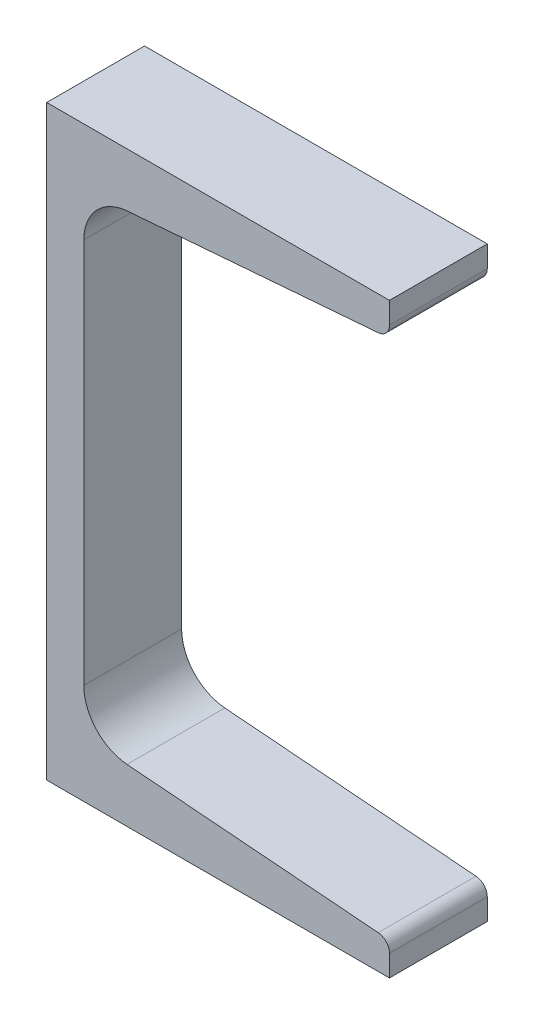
ISO-10303-21;
HEADER;
FILE_DESCRIPTION(('STEP AP214'),'2;1');
FILE_NAME('part.step','',(''),(''),'','','');
FILE_SCHEMA(('AUTOMOTIVE_DESIGN { 1 0 10303 214 1 1 1 1 }'));
ENDSEC;
DATA;
#1=APPLICATION_CONTEXT('core data for automotive mechanical design processes');
#2=APPLICATION_PROTOCOL_DEFINITION('international standard','automotive_design',2000,#1);
#3=PRODUCT_CONTEXT('',#1,'mechanical');
#4=PRODUCT('Part','Part','',(#3));
#5=PRODUCT_RELATED_PRODUCT_CATEGORY('part','',(#4));
#6=PRODUCT_DEFINITION_FORMATION('','',#4);
#7=PRODUCT_DEFINITION_CONTEXT('part definition',#1,'design');
#8=PRODUCT_DEFINITION('design','',#6,#7);
#9=PRODUCT_DEFINITION_SHAPE('','',#8);
#10=(LENGTH_UNIT() NAMED_UNIT(*) SI_UNIT(.MILLI.,.METRE.));
#11=(NAMED_UNIT(*) PLANE_ANGLE_UNIT() SI_UNIT($,.RADIAN.));
#12=(NAMED_UNIT(*) SI_UNIT($,.STERADIAN.) SOLID_ANGLE_UNIT());
#13=UNCERTAINTY_MEASURE_WITH_UNIT(LENGTH_MEASURE(1.E-05),#10,'distance_accuracy_value','');
#14=(GEOMETRIC_REPRESENTATION_CONTEXT(3) GLOBAL_UNCERTAINTY_ASSIGNED_CONTEXT((#13)) GLOBAL_UNIT_ASSIGNED_CONTEXT((#10,
#11,#12)) REPRESENTATION_CONTEXT('',''));
#15=CARTESIAN_POINT('',(0.,0.,0.));
#16=DIRECTION('',(0.,0.,1.));
#17=DIRECTION('',(1.,0.,0.));
#18=AXIS2_PLACEMENT_3D('',#15,#16,#17);
#19=CARTESIAN_POINT('',(0.,152.4,12.7));
#20=DIRECTION('',(1.,0.,0.));
#21=DIRECTION('',(0.,0.,-1.));
#22=AXIS2_PLACEMENT_3D('',#19,#20,#21);
#23=PLANE('',#22);
#24=DIRECTION('',(0.,-1.,0.));
#25=VECTOR('',#24,1.);
#26=CARTESIAN_POINT('',(0.,152.4,-12.7));
#27=LINE('',#26,#25);
#28=CARTESIAN_POINT('',(0.,152.4,-12.7));
#29=VERTEX_POINT('',#28);
#30=CARTESIAN_POINT('',(0.,0.,-12.7));
#31=VERTEX_POINT('',#30);
#32=EDGE_CURVE('E137',#29,#31,#27,.T.);
#33=ORIENTED_EDGE('',*,*,#32,.T.);
#34=DIRECTION('',(0.,0.,-1.));
#35=VECTOR('',#34,1.);
#36=CARTESIAN_POINT('',(0.,0.,12.7));
#37=LINE('',#36,#35);
#38=CARTESIAN_POINT('',(0.,0.,12.7));
#39=VERTEX_POINT('',#38);
#40=EDGE_CURVE('E135',#39,#31,#37,.T.);
#41=ORIENTED_EDGE('',*,*,#40,.F.);
#42=DIRECTION('',(0.,-1.,0.));
#43=VECTOR('',#42,1.);
#44=CARTESIAN_POINT('',(0.,152.4,12.7));
#45=LINE('',#44,#43);
#46=CARTESIAN_POINT('',(0.,152.4,12.7));
#47=VERTEX_POINT('',#46);
#48=EDGE_CURVE('E121',#47,#39,#45,.T.);
#49=ORIENTED_EDGE('',*,*,#48,.F.);
#50=DIRECTION('',(0.,0.,-1.));
#51=VECTOR('',#50,1.);
#52=CARTESIAN_POINT('',(0.,152.4,12.7));
#53=LINE('',#52,#51);
#54=EDGE_CURVE('E166',#47,#29,#53,.T.);
#55=ORIENTED_EDGE('',*,*,#54,.T.);
#56=EDGE_LOOP('',(#33,#41,#49,#55));
#57=FACE_BOUND('',#56,.T.);
#58=ADVANCED_FACE('F32',(#57),#23,.F.);
#59=CARTESIAN_POINT('',(89.0016,0.,12.7));
#60=DIRECTION('',(0.,-1.,0.));
#61=DIRECTION('',(1.,0.,0.));
#62=AXIS2_PLACEMENT_3D('',#59,#60,#61);
#63=PLANE('',#62);
#64=DIRECTION('',(-1.,0.,0.));
#65=VECTOR('',#64,1.);
#66=CARTESIAN_POINT('',(89.0016,0.,-12.7));
#67=LINE('',#66,#65);
#68=CARTESIAN_POINT('',(89.0016,0.,-12.7));
#69=VERTEX_POINT('',#68);
#70=EDGE_CURVE('E168',#69,#31,#67,.T.);
#71=ORIENTED_EDGE('',*,*,#70,.F.);
#72=DIRECTION('',(0.,0.,-1.));
#73=VECTOR('',#72,1.);
#74=CARTESIAN_POINT('',(89.0016,0.,12.7));
#75=LINE('',#74,#73);
#76=CARTESIAN_POINT('',(89.0016,0.,12.7));
#77=VERTEX_POINT('',#76);
#78=EDGE_CURVE('E142',#77,#69,#75,.T.);
#79=ORIENTED_EDGE('',*,*,#78,.F.);
#80=DIRECTION('',(-1.,0.,0.));
#81=VECTOR('',#80,1.);
#82=CARTESIAN_POINT('',(89.0016,0.,12.7));
#83=LINE('',#82,#81);
#84=EDGE_CURVE('E126',#77,#39,#83,.T.);
#85=ORIENTED_EDGE('',*,*,#84,.T.);
#86=ORIENTED_EDGE('',*,*,#40,.T.);
#87=EDGE_LOOP('',(#71,#79,#85,#86));
#88=FACE_BOUND('',#87,.T.);
#89=ADVANCED_FACE('F144',(#88),#63,.T.);
#90=CARTESIAN_POINT('',(89.0016,0.,12.7));
#91=DIRECTION('',(-1.,0.,0.));
#92=DIRECTION('',(0.,-1.,0.));
#93=AXIS2_PLACEMENT_3D('',#90,#91,#92);
#94=PLANE('',#93);
#95=DIRECTION('',(0.,1.,0.));
#96=VECTOR('',#95,1.);
#97=CARTESIAN_POINT('',(89.0016,0.,-12.7));
#98=LINE('',#97,#96);
#99=CARTESIAN_POINT('',(89.0016,5.573807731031,-12.7));
#100=VERTEX_POINT('',#99);
#101=EDGE_CURVE('E170',#69,#100,#98,.T.);
#102=ORIENTED_EDGE('',*,*,#101,.T.);
#103=DIRECTION('',(0.,0.,-1.));
#104=VECTOR('',#103,1.);
#105=CARTESIAN_POINT('',(89.0016,5.573807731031,12.7));
#106=LINE('',#105,#104);
#107=CARTESIAN_POINT('',(89.0016,5.573807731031,12.7));
#108=VERTEX_POINT('',#107);
#109=EDGE_CURVE('E209',#100,#108,#106,.F.);
#110=ORIENTED_EDGE('',*,*,#109,.T.);
#111=DIRECTION('',(0.,1.,0.));
#112=VECTOR('',#111,1.);
#113=CARTESIAN_POINT('',(89.0016,0.,12.7));
#114=LINE('',#113,#112);
#115=EDGE_CURVE('E146',#77,#108,#114,.T.);
#116=ORIENTED_EDGE('',*,*,#115,.F.);
#117=ORIENTED_EDGE('',*,*,#78,.T.);
#118=EDGE_LOOP('',(#102,#110,#116,#117));
#119=FACE_BOUND('',#118,.T.);
#120=ADVANCED_FACE('F240',(#119),#94,.F.);
#121=CARTESIAN_POINT('',(20.8463507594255,13.9573471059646,12.7));
#122=DIRECTION('',(0.0797448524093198,0.996815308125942,0.));
#123=DIRECTION('',(-0.996815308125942,0.0797448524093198,0.));
#124=AXIS2_PLACEMENT_3D('',#121,#122,#123);
#125=PLANE('',#124);
#126=DIRECTION('',(0.996815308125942,-0.0797448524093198,0.));
#127=VECTOR('',#126,1.);
#128=CARTESIAN_POINT('',(20.8463507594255,13.9573471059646,12.7));
#129=LINE('',#128,#127);
#130=CARTESIAN_POINT('',(20.8463507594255,13.9573471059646,12.7));
#131=VERTEX_POINT('',#130);
#132=CARTESIAN_POINT('',(86.0797899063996,8.73869633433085,12.7));
#133=VERTEX_POINT('',#132);
#134=EDGE_CURVE('E148',#131,#133,#129,.T.);
#135=ORIENTED_EDGE('',*,*,#134,.T.);
#136=DIRECTION('',(0.,0.,-1.));
#137=VECTOR('',#136,1.);
#138=CARTESIAN_POINT('',(86.0797899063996,8.73869633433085,-12.7));
#139=LINE('',#138,#137);
#140=CARTESIAN_POINT('',(86.0797899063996,8.73869633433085,-12.7));
#141=VERTEX_POINT('',#140);
#142=EDGE_CURVE('E141',#133,#141,#139,.T.);
#143=ORIENTED_EDGE('',*,*,#142,.T.);
#144=DIRECTION('',(0.996815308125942,-0.0797448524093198,0.));
#145=VECTOR('',#144,1.);
#146=CARTESIAN_POINT('',(20.8463507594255,13.9573471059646,-12.7));
#147=LINE('',#146,#145);
#148=CARTESIAN_POINT('',(20.8463507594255,13.9573471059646,-12.7));
#149=VERTEX_POINT('',#148);
#150=EDGE_CURVE('E173',#149,#141,#147,.T.);
#151=ORIENTED_EDGE('',*,*,#150,.F.);
#152=DIRECTION('',(0.,0.,-1.));
#153=VECTOR('',#152,1.);
#154=CARTESIAN_POINT('',(20.8463507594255,13.9573471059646,12.7));
#155=LINE('',#154,#153);
#156=EDGE_CURVE('E200',#131,#149,#155,.T.);
#157=ORIENTED_EDGE('',*,*,#156,.F.);
#158=EDGE_LOOP('',(#135,#143,#151,#157));
#159=FACE_BOUND('',#158,.T.);
#160=ADVANCED_FACE('F256',(#159),#125,.T.);
#161=CARTESIAN_POINT('',(21.8186,26.1105193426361,12.7));
#162=DIRECTION('',(0.,0.,-1.));
#163=DIRECTION('',(-1.,0.,0.));
#164=AXIS2_PLACEMENT_3D('',#161,#162,#163);
#165=CYLINDRICAL_SURFACE('',#164,12.192);
#166=CARTESIAN_POINT('',(21.8186,26.1105193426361,-12.7));
#167=DIRECTION('',(0.,0.,1.));
#168=DIRECTION('',(1.,0.,0.));
#169=AXIS2_PLACEMENT_3D('',#166,#167,#168);
#170=CIRCLE('',#169,12.192);
#171=CARTESIAN_POINT('',(9.62659999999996,26.1105193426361,-12.7));
#172=VERTEX_POINT('',#171);
#173=EDGE_CURVE('E176',#172,#149,#170,.T.);
#174=ORIENTED_EDGE('',*,*,#173,.F.);
#175=DIRECTION('',(0.,0.,-1.));
#176=VECTOR('',#175,1.);
#177=CARTESIAN_POINT('',(9.62659999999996,26.1105193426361,12.7));
#178=LINE('',#177,#176);
#179=CARTESIAN_POINT('',(9.62659999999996,26.1105193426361,12.7));
#180=VERTEX_POINT('',#179);
#181=EDGE_CURVE('E198',#180,#172,#178,.T.);
#182=ORIENTED_EDGE('',*,*,#181,.F.);
#183=CARTESIAN_POINT('',(21.8186,26.1105193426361,12.7));
#184=DIRECTION('',(0.,0.,1.));
#185=DIRECTION('',(1.,0.,0.));
#186=AXIS2_PLACEMENT_3D('',#183,#184,#185);
#187=CIRCLE('',#186,12.192);
#188=EDGE_CURVE('E153',#180,#131,#187,.T.);
#189=ORIENTED_EDGE('',*,*,#188,.T.);
#190=ORIENTED_EDGE('',*,*,#156,.T.);
#191=EDGE_LOOP('',(#174,#182,#189,#190));
#192=FACE_BOUND('',#191,.T.);
#193=ADVANCED_FACE('F260',(#192),#165,.F.);
#194=CARTESIAN_POINT('',(9.62659999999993,126.289480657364,12.7));
#195=DIRECTION('',(1.,0.,0.));
#196=DIRECTION('',(0.,1.,0.));
#197=AXIS2_PLACEMENT_3D('',#194,#195,#196);
#198=PLANE('',#197);
#199=DIRECTION('',(0.,-1.,0.));
#200=VECTOR('',#199,1.);
#201=CARTESIAN_POINT('',(9.62659999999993,126.289480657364,-12.7));
#202=LINE('',#201,#200);
#203=CARTESIAN_POINT('',(9.62659999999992,126.289480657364,-12.7));
#204=VERTEX_POINT('',#203);
#205=EDGE_CURVE('E179',#204,#172,#202,.T.);
#206=ORIENTED_EDGE('',*,*,#205,.F.);
#207=DIRECTION('',(0.,0.,-1.));
#208=VECTOR('',#207,1.);
#209=CARTESIAN_POINT('',(9.62659999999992,126.289480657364,12.7));
#210=LINE('',#209,#208);
#211=CARTESIAN_POINT('',(9.62659999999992,126.289480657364,12.7));
#212=VERTEX_POINT('',#211);
#213=EDGE_CURVE('E196',#212,#204,#210,.T.);
#214=ORIENTED_EDGE('',*,*,#213,.F.);
#215=DIRECTION('',(0.,-1.,0.));
#216=VECTOR('',#215,1.);
#217=CARTESIAN_POINT('',(9.62659999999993,126.289480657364,12.7));
#218=LINE('',#217,#216);
#219=EDGE_CURVE('E156',#212,#180,#218,.T.);
#220=ORIENTED_EDGE('',*,*,#219,.T.);
#221=ORIENTED_EDGE('',*,*,#181,.T.);
#222=EDGE_LOOP('',(#206,#214,#220,#221));
#223=FACE_BOUND('',#222,.T.);
#224=ADVANCED_FACE('F264',(#223),#198,.T.);
#225=CARTESIAN_POINT('',(21.8186,126.289480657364,12.7));
#226=DIRECTION('',(0.,0.,-1.));
#227=DIRECTION('',(-1.,0.,0.));
#228=AXIS2_PLACEMENT_3D('',#225,#226,#227);
#229=CYLINDRICAL_SURFACE('',#228,12.192);
#230=CARTESIAN_POINT('',(21.8186,126.289480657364,-12.7));
#231=DIRECTION('',(0.,0.,-1.));
#232=DIRECTION('',(-1.,0.,0.));
#233=AXIS2_PLACEMENT_3D('',#230,#231,#232);
#234=CIRCLE('',#233,12.192);
#235=CARTESIAN_POINT('',(20.8463507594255,138.442652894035,-12.7));
#236=VERTEX_POINT('',#235);
#237=EDGE_CURVE('E182',#204,#236,#234,.T.);
#238=ORIENTED_EDGE('',*,*,#237,.T.);
#239=DIRECTION('',(0.,0.,-1.));
#240=VECTOR('',#239,1.);
#241=CARTESIAN_POINT('',(20.8463507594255,138.442652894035,12.7));
#242=LINE('',#241,#240);
#243=CARTESIAN_POINT('',(20.8463507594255,138.442652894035,12.7));
#244=VERTEX_POINT('',#243);
#245=EDGE_CURVE('E193',#244,#236,#242,.T.);
#246=ORIENTED_EDGE('',*,*,#245,.F.);
#247=CARTESIAN_POINT('',(21.8186,126.289480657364,12.7));
#248=DIRECTION('',(0.,0.,-1.));
#249=DIRECTION('',(-1.,0.,0.));
#250=AXIS2_PLACEMENT_3D('',#247,#248,#249);
#251=CIRCLE('',#250,12.192);
#252=EDGE_CURVE('E159',#212,#244,#251,.T.);
#253=ORIENTED_EDGE('',*,*,#252,.F.);
#254=ORIENTED_EDGE('',*,*,#213,.T.);
#255=EDGE_LOOP('',(#238,#246,#253,#254));
#256=FACE_BOUND('',#255,.T.);
#257=ADVANCED_FACE('F269',(#256),#229,.F.);
#258=CARTESIAN_POINT('',(20.8463507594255,138.442652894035,12.7));
#259=DIRECTION('',(-0.0797448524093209,0.996815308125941,0.));
#260=DIRECTION('',(-0.996815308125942,-0.0797448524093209,0.));
#261=AXIS2_PLACEMENT_3D('',#258,#259,#260);
#262=PLANE('',#261);
#263=DIRECTION('',(0.996815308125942,0.0797448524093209,0.));
#264=VECTOR('',#263,1.);
#265=CARTESIAN_POINT('',(20.8463507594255,138.442652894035,-12.7));
#266=LINE('',#265,#264);
#267=CARTESIAN_POINT('',(86.0797899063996,143.661303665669,-12.7));
#268=VERTEX_POINT('',#267);
#269=EDGE_CURVE('E184',#236,#268,#266,.T.);
#270=ORIENTED_EDGE('',*,*,#269,.T.);
#271=DIRECTION('',(0.,0.,-1.));
#272=VECTOR('',#271,1.);
#273=CARTESIAN_POINT('',(86.0797899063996,143.661303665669,12.7));
#274=LINE('',#273,#272);
#275=CARTESIAN_POINT('',(86.0797899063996,143.661303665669,12.7));
#276=VERTEX_POINT('',#275);
#277=EDGE_CURVE('E11',#268,#276,#274,.F.);
#278=ORIENTED_EDGE('',*,*,#277,.T.);
#279=DIRECTION('',(0.996815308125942,0.0797448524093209,0.));
#280=VECTOR('',#279,1.);
#281=CARTESIAN_POINT('',(20.8463507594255,138.442652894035,12.7));
#282=LINE('',#281,#280);
#283=EDGE_CURVE('E161',#244,#276,#282,.T.);
#284=ORIENTED_EDGE('',*,*,#283,.F.);
#285=ORIENTED_EDGE('',*,*,#245,.T.);
#286=EDGE_LOOP('',(#270,#278,#284,#285));
#287=FACE_BOUND('',#286,.T.);
#288=ADVANCED_FACE('F232',(#287),#262,.F.);
#289=CARTESIAN_POINT('',(89.0016,152.4,12.7));
#290=DIRECTION('',(1.,0.,0.));
#291=DIRECTION('',(0.,1.,0.));
#292=AXIS2_PLACEMENT_3D('',#289,#290,#291);
#293=PLANE('',#292);
#294=DIRECTION('',(0.,-1.,0.));
#295=VECTOR('',#294,1.);
#296=CARTESIAN_POINT('',(89.0016,152.4,12.7));
#297=LINE('',#296,#295);
#298=CARTESIAN_POINT('',(89.0016,152.4,12.7));
#299=VERTEX_POINT('',#298);
#300=CARTESIAN_POINT('',(89.0016,146.826192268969,12.7));
#301=VERTEX_POINT('',#300);
#302=EDGE_CURVE('E163',#299,#301,#297,.T.);
#303=ORIENTED_EDGE('',*,*,#302,.T.);
#304=DIRECTION('',(0.,0.,-1.));
#305=VECTOR('',#304,1.);
#306=CARTESIAN_POINT('',(89.0016,146.826192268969,-12.7));
#307=LINE('',#306,#305);
#308=CARTESIAN_POINT('',(89.0016,146.826192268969,-12.7));
#309=VERTEX_POINT('',#308);
#310=EDGE_CURVE('E40',#301,#309,#307,.T.);
#311=ORIENTED_EDGE('',*,*,#310,.T.);
#312=DIRECTION('',(0.,-1.,0.));
#313=VECTOR('',#312,1.);
#314=CARTESIAN_POINT('',(89.0016,152.4,-12.7));
#315=LINE('',#314,#313);
#316=CARTESIAN_POINT('',(89.0016,152.4,-12.7));
#317=VERTEX_POINT('',#316);
#318=EDGE_CURVE('E186',#317,#309,#315,.T.);
#319=ORIENTED_EDGE('',*,*,#318,.F.);
#320=DIRECTION('',(0.,0.,-1.));
#321=VECTOR('',#320,1.);
#322=CARTESIAN_POINT('',(89.0016,152.4,12.7));
#323=LINE('',#322,#321);
#324=EDGE_CURVE('E191',#299,#317,#323,.T.);
#325=ORIENTED_EDGE('',*,*,#324,.F.);
#326=EDGE_LOOP('',(#303,#311,#319,#325));
#327=FACE_BOUND('',#326,.T.);
#328=ADVANCED_FACE('F217',(#327),#293,.T.);
#329=CARTESIAN_POINT('',(89.0016,152.4,12.7));
#330=DIRECTION('',(0.,-1.,0.));
#331=DIRECTION('',(0.,0.,-1.));
#332=AXIS2_PLACEMENT_3D('',#329,#330,#331);
#333=PLANE('',#332);
#334=DIRECTION('',(-1.,0.,0.));
#335=VECTOR('',#334,1.);
#336=CARTESIAN_POINT('',(89.0016,152.4,-12.7));
#337=LINE('',#336,#335);
#338=EDGE_CURVE('E132',#317,#29,#337,.T.);
#339=ORIENTED_EDGE('',*,*,#338,.T.);
#340=ORIENTED_EDGE('',*,*,#54,.F.);
#341=DIRECTION('',(-1.,0.,0.));
#342=VECTOR('',#341,1.);
#343=CARTESIAN_POINT('',(89.0016,152.4,12.7));
#344=LINE('',#343,#342);
#345=EDGE_CURVE('E128',#299,#47,#344,.T.);
#346=ORIENTED_EDGE('',*,*,#345,.F.);
#347=ORIENTED_EDGE('',*,*,#324,.T.);
#348=EDGE_LOOP('',(#339,#340,#346,#347));
#349=FACE_BOUND('',#348,.T.);
#350=ADVANCED_FACE('F224',(#349),#333,.F.);
#351=CARTESIAN_POINT('',(21.8186,26.1105193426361,12.7));
#352=DIRECTION('',(0.,0.,1.));
#353=DIRECTION('',(1.,0.,0.));
#354=AXIS2_PLACEMENT_3D('',#351,#352,#353);
#355=PLANE('',#354);
#356=ORIENTED_EDGE('',*,*,#115,.T.);
#357=CARTESIAN_POINT('',(85.8266,5.57380773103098,12.7));
#358=DIRECTION('',(0.,0.,1.));
#359=DIRECTION('',(1.,0.,0.));
#360=AXIS2_PLACEMENT_3D('',#357,#358,#359);
#361=CIRCLE('',#360,3.175);
#362=EDGE_CURVE('E212',#108,#133,#361,.T.);
#363=ORIENTED_EDGE('',*,*,#362,.T.);
#364=ORIENTED_EDGE('',*,*,#134,.F.);
#365=ORIENTED_EDGE('',*,*,#188,.F.);
#366=ORIENTED_EDGE('',*,*,#219,.F.);
#367=ORIENTED_EDGE('',*,*,#252,.T.);
#368=ORIENTED_EDGE('',*,*,#283,.T.);
#369=CARTESIAN_POINT('',(85.8266,146.826192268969,12.7));
#370=DIRECTION('',(0.,0.,1.));
#371=DIRECTION('',(1.,0.,0.));
#372=AXIS2_PLACEMENT_3D('',#369,#370,#371);
#373=CIRCLE('',#372,3.175);
#374=EDGE_CURVE('E47',#276,#301,#373,.T.);
#375=ORIENTED_EDGE('',*,*,#374,.T.);
#376=ORIENTED_EDGE('',*,*,#302,.F.);
#377=ORIENTED_EDGE('',*,*,#345,.T.);
#378=ORIENTED_EDGE('',*,*,#48,.T.);
#379=ORIENTED_EDGE('',*,*,#84,.F.);
#380=EDGE_LOOP('',(#356,#363,#364,#365,#366,#367,#368,#375,#376,#377,#378,#379));
#381=FACE_BOUND('',#380,.T.);
#382=ADVANCED_FACE('F124',(#381),#355,.T.);
#383=CARTESIAN_POINT('',(21.8186,26.1105193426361,-12.7));
#384=DIRECTION('',(0.,0.,1.));
#385=DIRECTION('',(1.,0.,0.));
#386=AXIS2_PLACEMENT_3D('',#383,#384,#385);
#387=PLANE('',#386);
#388=ORIENTED_EDGE('',*,*,#150,.T.);
#389=CARTESIAN_POINT('',(85.8266,5.57380773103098,-12.7));
#390=DIRECTION('',(0.,0.,1.));
#391=DIRECTION('',(1.,0.,0.));
#392=AXIS2_PLACEMENT_3D('',#389,#390,#391);
#393=CIRCLE('',#392,3.175);
#394=EDGE_CURVE('E207',#141,#100,#393,.F.);
#395=ORIENTED_EDGE('',*,*,#394,.T.);
#396=ORIENTED_EDGE('',*,*,#101,.F.);
#397=ORIENTED_EDGE('',*,*,#70,.T.);
#398=ORIENTED_EDGE('',*,*,#32,.F.);
#399=ORIENTED_EDGE('',*,*,#338,.F.);
#400=ORIENTED_EDGE('',*,*,#318,.T.);
#401=CARTESIAN_POINT('',(85.8266,146.826192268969,-12.7));
#402=DIRECTION('',(0.,0.,1.));
#403=DIRECTION('',(1.,0.,0.));
#404=AXIS2_PLACEMENT_3D('',#401,#402,#403);
#405=CIRCLE('',#404,3.175);
#406=EDGE_CURVE('E205',#309,#268,#405,.F.);
#407=ORIENTED_EDGE('',*,*,#406,.T.);
#408=ORIENTED_EDGE('',*,*,#269,.F.);
#409=ORIENTED_EDGE('',*,*,#237,.F.);
#410=ORIENTED_EDGE('',*,*,#205,.T.);
#411=ORIENTED_EDGE('',*,*,#173,.T.);
#412=EDGE_LOOP('',(#388,#395,#396,#397,#398,#399,#400,#407,#408,#409,#410,#411));
#413=FACE_BOUND('',#412,.T.);
#414=ADVANCED_FACE('F221',(#413),#387,.F.);
#415=CARTESIAN_POINT('',(85.8266,5.57380773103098,12.7));
#416=DIRECTION('',(0.,0.,1.));
#417=DIRECTION('',(1.,0.,0.));
#418=AXIS2_PLACEMENT_3D('',#415,#416,#417);
#419=CYLINDRICAL_SURFACE('',#418,3.175);
#420=ORIENTED_EDGE('',*,*,#362,.F.);
#421=ORIENTED_EDGE('',*,*,#109,.F.);
#422=ORIENTED_EDGE('',*,*,#394,.F.);
#423=ORIENTED_EDGE('',*,*,#142,.F.);
#424=EDGE_LOOP('',(#420,#421,#422,#423));
#425=FACE_BOUND('',#424,.T.);
#426=ADVANCED_FACE('F243',(#425),#419,.T.);
#427=CARTESIAN_POINT('',(85.8266,146.826192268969,12.7));
#428=DIRECTION('',(0.,0.,1.));
#429=DIRECTION('',(1.,0.,0.));
#430=AXIS2_PLACEMENT_3D('',#427,#428,#429);
#431=CYLINDRICAL_SURFACE('',#430,3.175);
#432=ORIENTED_EDGE('',*,*,#374,.F.);
#433=ORIENTED_EDGE('',*,*,#277,.F.);
#434=ORIENTED_EDGE('',*,*,#406,.F.);
#435=ORIENTED_EDGE('',*,*,#310,.F.);
#436=EDGE_LOOP('',(#432,#433,#434,#435));
#437=FACE_BOUND('',#436,.T.);
#438=ADVANCED_FACE('F34',(#437),#431,.T.);
#439=CLOSED_SHELL('',(#58,#89,#120,#160,#193,#224,#257,#288,#328,#350,#382,#414,#426,#438));
#440=MANIFOLD_SOLID_BREP('B2',#439);
#441=ADVANCED_BREP_SHAPE_REPRESENTATION('',(#18,#440),#14);
#442=SHAPE_DEFINITION_REPRESENTATION(#9,#441);
ENDSEC;
END-ISO-10303-21;
